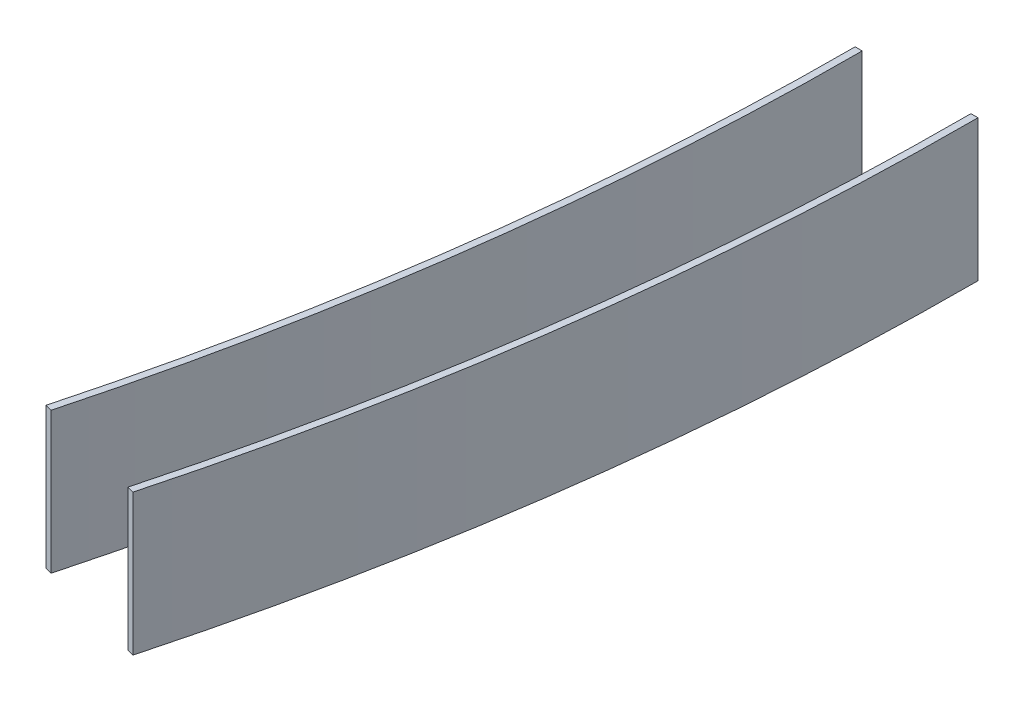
from build123d import *

# Parameters (mm, degrees)
SKETCH_1_W      = 0.5
SKETCH_1_H      = 10
REVOLVE_1_ANGLE = 15


with BuildPart() as part:
    # Sketch 1 → Revolve 1 (revolve)
    with BuildSketch(Plane.XY):
        with Locations((195.9, -4.75)):
            Rectangle(SKETCH_1_W, SKETCH_1_H)
        with Locations((204.1, -4.75)):
            Rectangle(SKETCH_1_W, SKETCH_1_H)
    revolve(axis=Axis((0, 44.11016669, 0), (0, -1, 0)), revolution_arc=REVOLVE_1_ANGLE)


solid = part.part
